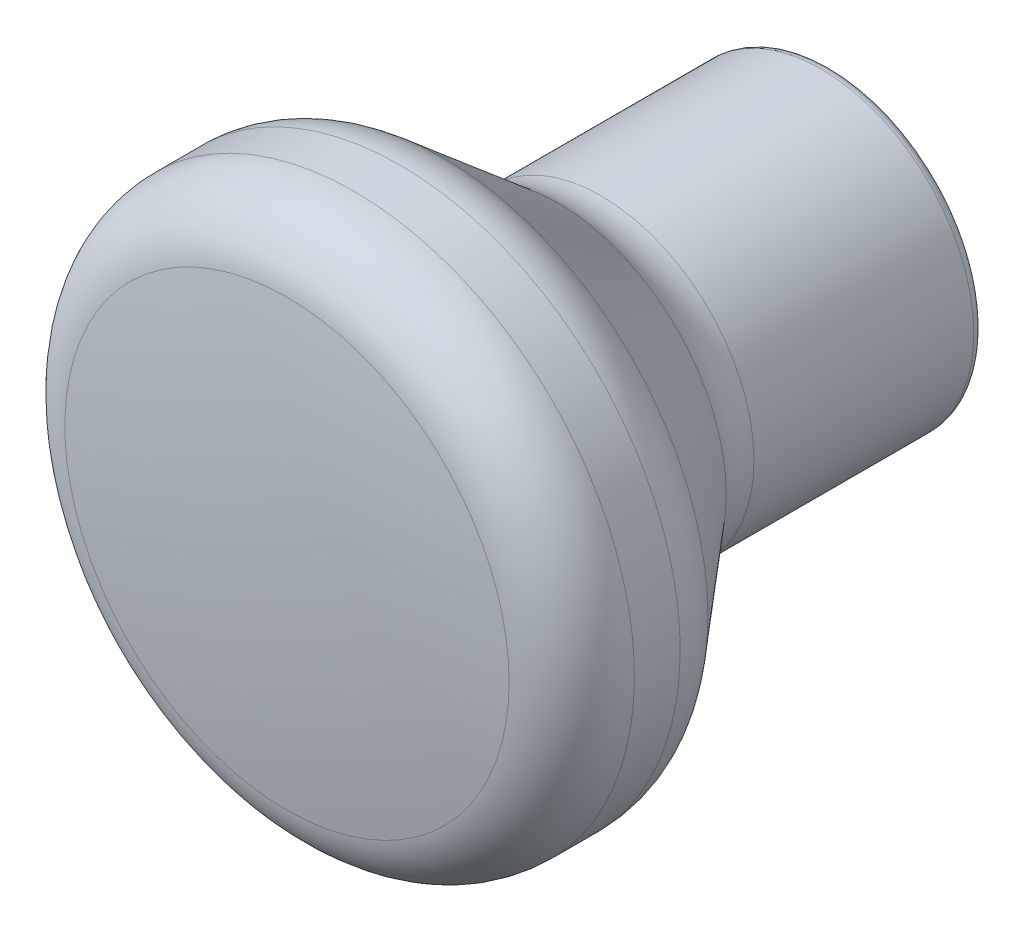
ISO-10303-21;
HEADER;
FILE_DESCRIPTION(('STEP AP214'),'2;1');
FILE_NAME('part.step','',(''),(''),'','','');
FILE_SCHEMA(('AUTOMOTIVE_DESIGN { 1 0 10303 214 1 1 1 1 }'));
ENDSEC;
DATA;
#1=APPLICATION_CONTEXT('core data for automotive mechanical design processes');
#2=APPLICATION_PROTOCOL_DEFINITION('international standard','automotive_design',2000,#1);
#3=PRODUCT_CONTEXT('',#1,'mechanical');
#4=PRODUCT('Part','Part','',(#3));
#5=PRODUCT_RELATED_PRODUCT_CATEGORY('part','',(#4));
#6=PRODUCT_DEFINITION_FORMATION('','',#4);
#7=PRODUCT_DEFINITION_CONTEXT('part definition',#1,'design');
#8=PRODUCT_DEFINITION('design','',#6,#7);
#9=PRODUCT_DEFINITION_SHAPE('','',#8);
#10=(LENGTH_UNIT() NAMED_UNIT(*) SI_UNIT(.MILLI.,.METRE.));
#11=(NAMED_UNIT(*) PLANE_ANGLE_UNIT() SI_UNIT($,.RADIAN.));
#12=(NAMED_UNIT(*) SI_UNIT($,.STERADIAN.) SOLID_ANGLE_UNIT());
#13=UNCERTAINTY_MEASURE_WITH_UNIT(LENGTH_MEASURE(1.E-05),#10,'distance_accuracy_value','');
#14=(GEOMETRIC_REPRESENTATION_CONTEXT(3) GLOBAL_UNCERTAINTY_ASSIGNED_CONTEXT((#13)) GLOBAL_UNIT_ASSIGNED_CONTEXT((#10,
#11,#12)) REPRESENTATION_CONTEXT('',''));
#15=CARTESIAN_POINT('',(0.,0.,0.));
#16=DIRECTION('',(0.,0.,1.));
#17=DIRECTION('',(1.,0.,0.));
#18=AXIS2_PLACEMENT_3D('',#15,#16,#17);
#19=CARTESIAN_POINT('',(-2.87096735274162E-13,0.,-57.0000000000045));
#20=DIRECTION('',(0.,0.,-1.));
#21=DIRECTION('',(1.,0.,0.));
#22=AXIS2_PLACEMENT_3D('',#19,#20,#21);
#23=SPHERICAL_SURFACE('',#22,90.0000000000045);
#24=CARTESIAN_POINT('',(0.,0.,32.0442423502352));
#25=DIRECTION('',(0.,0.,-1.));
#26=DIRECTION('',(0.,1.,0.));
#27=AXIS2_PLACEMENT_3D('',#24,#25,#26);
#28=CIRCLE('',#27,13.0813953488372);
#29=CARTESIAN_POINT('',(0.,13.0813953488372,32.0442423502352));
#30=VERTEX_POINT('',#29);
#31=EDGE_CURVE('E8',#30,#30,#28,.T.);
#32=ORIENTED_EDGE('',*,*,#31,.F.);
#33=EDGE_LOOP('',(#32));
#34=FACE_BOUND('',#33,.T.);
#35=ADVANCED_FACE('F12',(#34),#23,.T.);
#36=CARTESIAN_POINT('',(0.,0.,28.0867204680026));
#37=DIRECTION('',(0.,0.,-1.));
#38=DIRECTION('',(0.,1.,0.));
#39=AXIS2_PLACEMENT_3D('',#36,#37,#38);
#40=TOROIDAL_SURFACE('',#39,12.5,4.);
#41=ORIENTED_EDGE('',*,*,#31,.T.);
#42=EDGE_LOOP('',(#41));
#43=FACE_BOUND('',#42,.T.);
#44=CARTESIAN_POINT('',(0.,0.,28.0867204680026));
#45=DIRECTION('',(0.,0.,-1.));
#46=DIRECTION('',(0.,1.,0.));
#47=AXIS2_PLACEMENT_3D('',#44,#45,#46);
#48=CIRCLE('',#47,16.5);
#49=CARTESIAN_POINT('',(0.,16.5,28.0867204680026));
#50=VERTEX_POINT('',#49);
#51=EDGE_CURVE('E18',#50,#50,#48,.T.);
#52=ORIENTED_EDGE('',*,*,#51,.F.);
#53=EDGE_LOOP('',(#52));
#54=FACE_BOUND('',#53,.T.);
#55=ADVANCED_FACE('F77',(#43,#54),#40,.T.);
#56=CARTESIAN_POINT('',(0.,0.,0.));
#57=DIRECTION('',(0.,0.,-1.));
#58=DIRECTION('',(0.,1.,0.));
#59=AXIS2_PLACEMENT_3D('',#56,#57,#58);
#60=CYLINDRICAL_SURFACE('',#59,16.5);
#61=CARTESIAN_POINT('',(0.,0.,25.3940328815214));
#62=DIRECTION('',(0.,0.,-1.));
#63=DIRECTION('',(0.,1.,0.));
#64=AXIS2_PLACEMENT_3D('',#61,#62,#63);
#65=CIRCLE('',#64,16.5);
#66=CARTESIAN_POINT('',(0.,16.5,25.3940328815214));
#67=VERTEX_POINT('',#66);
#68=EDGE_CURVE('E22',#67,#67,#65,.T.);
#69=ORIENTED_EDGE('',*,*,#68,.F.);
#70=EDGE_LOOP('',(#69));
#71=FACE_BOUND('',#70,.T.);
#72=ORIENTED_EDGE('',*,*,#51,.T.);
#73=EDGE_LOOP('',(#72));
#74=FACE_BOUND('',#73,.T.);
#75=ADVANCED_FACE('F82',(#71,#74),#60,.T.);
#76=CARTESIAN_POINT('',(0.,0.,25.3940328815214));
#77=DIRECTION('',(0.,0.,-1.));
#78=DIRECTION('',(0.,1.,0.));
#79=AXIS2_PLACEMENT_3D('',#76,#77,#78);
#80=TOROIDAL_SURFACE('',#79,12.5,4.);
#81=ORIENTED_EDGE('',*,*,#68,.T.);
#82=EDGE_LOOP('',(#81));
#83=FACE_BOUND('',#82,.T.);
#84=CARTESIAN_POINT('',(0.,0.,22.8228824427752));
#85=DIRECTION('',(0.,0.,-1.));
#86=DIRECTION('',(0.,1.,0.));
#87=AXIS2_PLACEMENT_3D('',#84,#85,#86);
#88=CIRCLE('',#87,15.5641777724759);
#89=CARTESIAN_POINT('',(0.,15.5641777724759,22.8228824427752));
#90=VERTEX_POINT('',#89);
#91=EDGE_CURVE('E26',#90,#90,#88,.T.);
#92=ORIENTED_EDGE('',*,*,#91,.F.);
#93=EDGE_LOOP('',(#92));
#94=FACE_BOUND('',#93,.T.);
#95=ADVANCED_FACE('F86',(#83,#94),#80,.T.);
#96=CARTESIAN_POINT('',(0.,0.,22.8228824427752));
#97=DIRECTION('',(0.,0.,1.));
#98=DIRECTION('',(0.,-1.,0.));
#99=AXIS2_PLACEMENT_3D('',#96,#97,#98);
#100=CONICAL_SURFACE('',#99,15.5641777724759,0.698131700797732);
#101=CARTESIAN_POINT('',(0.,0.,16.1152695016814));
#102=DIRECTION('',(0.,0.,-1.));
#103=DIRECTION('',(0.,1.,0.));
#104=AXIS2_PLACEMENT_3D('',#101,#102,#103);
#105=CIRCLE('',#104,9.93582222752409);
#106=CARTESIAN_POINT('',(0.,9.93582222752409,16.1152695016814));
#107=VERTEX_POINT('',#106);
#108=EDGE_CURVE('E31',#107,#107,#105,.T.);
#109=ORIENTED_EDGE('',*,*,#108,.F.);
#110=EDGE_LOOP('',(#109));
#111=FACE_BOUND('',#110,.T.);
#112=ORIENTED_EDGE('',*,*,#91,.T.);
#113=EDGE_LOOP('',(#112));
#114=FACE_BOUND('',#113,.T.);
#115=ADVANCED_FACE('F93',(#111,#114),#100,.T.);
#116=CARTESIAN_POINT('',(0.,0.,13.5441190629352));
#117=DIRECTION('',(0.,0.,-1.));
#118=DIRECTION('',(0.,1.,0.));
#119=AXIS2_PLACEMENT_3D('',#116,#117,#118);
#120=TOROIDAL_SURFACE('',#119,13.,4.);
#121=CARTESIAN_POINT('',(0.,0.,13.5441190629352));
#122=DIRECTION('',(0.,0.,-1.));
#123=DIRECTION('',(0.,1.,0.));
#124=AXIS2_PLACEMENT_3D('',#121,#122,#123);
#125=CIRCLE('',#124,9.);
#126=CARTESIAN_POINT('',(0.,9.,13.5441190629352));
#127=VERTEX_POINT('',#126);
#128=EDGE_CURVE('E34',#127,#127,#125,.T.);
#129=ORIENTED_EDGE('',*,*,#128,.F.);
#130=EDGE_LOOP('',(#129));
#131=FACE_BOUND('',#130,.T.);
#132=ORIENTED_EDGE('',*,*,#108,.T.);
#133=EDGE_LOOP('',(#132));
#134=FACE_BOUND('',#133,.T.);
#135=ADVANCED_FACE('F73',(#131,#134),#120,.F.);
#136=CARTESIAN_POINT('',(0.,0.,0.));
#137=DIRECTION('',(0.,0.,-1.));
#138=DIRECTION('',(0.,1.,0.));
#139=AXIS2_PLACEMENT_3D('',#136,#137,#138);
#140=CYLINDRICAL_SURFACE('',#139,9.);
#141=CARTESIAN_POINT('',(0.,0.,0.6));
#142=DIRECTION('',(0.,0.,-1.));
#143=DIRECTION('',(0.,1.,0.));
#144=AXIS2_PLACEMENT_3D('',#141,#142,#143);
#145=CIRCLE('',#144,9.);
#146=CARTESIAN_POINT('',(0.,9.,0.6));
#147=VERTEX_POINT('',#146);
#148=EDGE_CURVE('E37',#147,#147,#145,.T.);
#149=ORIENTED_EDGE('',*,*,#148,.F.);
#150=EDGE_LOOP('',(#149));
#151=FACE_BOUND('',#150,.T.);
#152=ORIENTED_EDGE('',*,*,#128,.T.);
#153=EDGE_LOOP('',(#152));
#154=FACE_BOUND('',#153,.T.);
#155=ADVANCED_FACE('F66',(#151,#154),#140,.T.);
#156=CARTESIAN_POINT('',(0.,0.,0.6));
#157=DIRECTION('',(0.,0.,-1.));
#158=DIRECTION('',(0.,1.,0.));
#159=AXIS2_PLACEMENT_3D('',#156,#157,#158);
#160=TOROIDAL_SURFACE('',#159,8.4,0.6);
#161=ORIENTED_EDGE('',*,*,#148,.T.);
#162=EDGE_LOOP('',(#161));
#163=FACE_BOUND('',#162,.T.);
#164=CARTESIAN_POINT('',(0.,0.,0.));
#165=DIRECTION('',(0.,0.,-1.));
#166=DIRECTION('',(0.,1.,0.));
#167=AXIS2_PLACEMENT_3D('',#164,#165,#166);
#168=CIRCLE('',#167,8.4);
#169=CARTESIAN_POINT('',(0.,8.4,0.));
#170=VERTEX_POINT('',#169);
#171=EDGE_CURVE('E40',#170,#170,#168,.T.);
#172=ORIENTED_EDGE('',*,*,#171,.F.);
#173=EDGE_LOOP('',(#172));
#174=FACE_BOUND('',#173,.T.);
#175=ADVANCED_FACE('F61',(#163,#174),#160,.T.);
#176=CARTESIAN_POINT('',(8.4,0.,0.));
#177=DIRECTION('',(0.,0.,1.));
#178=DIRECTION('',(0.,-1.,0.));
#179=AXIS2_PLACEMENT_3D('',#176,#177,#178);
#180=PLANE('',#179);
#181=CARTESIAN_POINT('',(0.,0.,0.));
#182=DIRECTION('',(0.,0.,-1.));
#183=DIRECTION('',(0.,1.,0.));
#184=AXIS2_PLACEMENT_3D('',#181,#182,#183);
#185=CIRCLE('',#184,4.);
#186=CARTESIAN_POINT('',(0.,4.,0.));
#187=VERTEX_POINT('',#186);
#188=EDGE_CURVE('E44',#187,#187,#185,.T.);
#189=ORIENTED_EDGE('',*,*,#188,.F.);
#190=EDGE_LOOP('',(#189));
#191=FACE_BOUND('',#190,.T.);
#192=ORIENTED_EDGE('',*,*,#171,.T.);
#193=EDGE_LOOP('',(#192));
#194=FACE_BOUND('',#193,.T.);
#195=ADVANCED_FACE('F55',(#191,#194),#180,.F.);
#196=CARTESIAN_POINT('',(0.,0.,16.));
#197=DIRECTION('',(0.,0.,-1.));
#198=DIRECTION('',(0.,1.,0.));
#199=AXIS2_PLACEMENT_3D('',#196,#197,#198);
#200=CYLINDRICAL_SURFACE('',#199,4.);
#201=CARTESIAN_POINT('',(0.,0.,16.));
#202=DIRECTION('',(0.,0.,-1.));
#203=DIRECTION('',(0.,1.,0.));
#204=AXIS2_PLACEMENT_3D('',#201,#202,#203);
#205=CIRCLE('',#204,4.);
#206=CARTESIAN_POINT('',(0.,4.,16.));
#207=VERTEX_POINT('',#206);
#208=EDGE_CURVE('E43',#207,#207,#205,.T.);
#209=ORIENTED_EDGE('',*,*,#208,.F.);
#210=EDGE_LOOP('',(#209));
#211=FACE_BOUND('',#210,.T.);
#212=ORIENTED_EDGE('',*,*,#188,.T.);
#213=EDGE_LOOP('',(#212));
#214=FACE_BOUND('',#213,.T.);
#215=ADVANCED_FACE('F52',(#211,#214),#200,.F.);
#216=CARTESIAN_POINT('',(0.,0.,16.));
#217=DIRECTION('',(0.,0.,-1.));
#218=DIRECTION('',(0.,1.,0.));
#219=AXIS2_PLACEMENT_3D('',#216,#217,#218);
#220=PLANE('',#219);
#221=ORIENTED_EDGE('',*,*,#208,.T.);
#222=EDGE_LOOP('',(#221));
#223=FACE_BOUND('',#222,.T.);
#224=ADVANCED_FACE('F50',(#223),#220,.T.);
#225=CLOSED_SHELL('',(#35,#55,#75,#95,#115,#135,#155,#175,#195,#215,#224));
#226=MANIFOLD_SOLID_BREP('B1',#225);
#227=ADVANCED_BREP_SHAPE_REPRESENTATION('',(#18,#226),#14);
#228=SHAPE_DEFINITION_REPRESENTATION(#9,#227);
ENDSEC;
END-ISO-10303-21;
